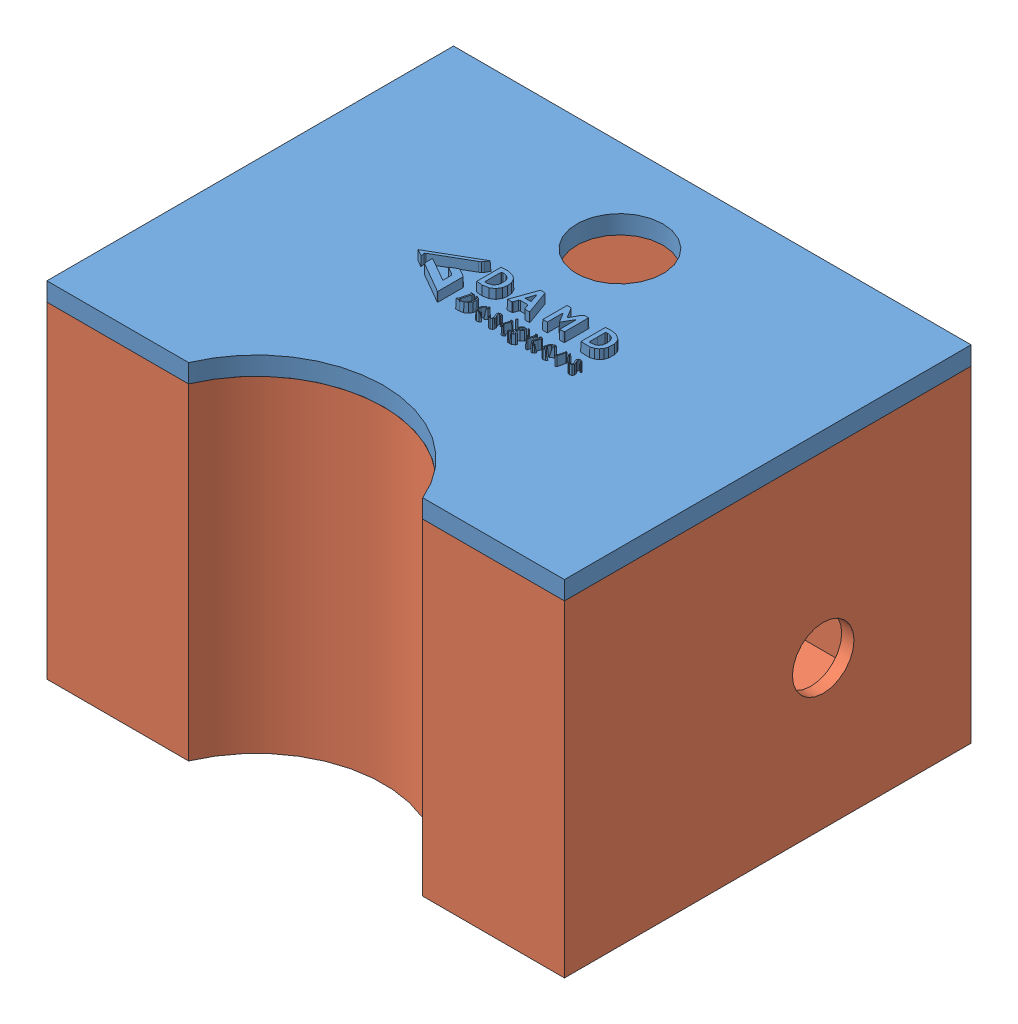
SolidWorks assembly airfreshner_enclosure assemble.sldasm, configuration Default (file format 15000). Lengths in mm.
Overall size (84 57.5 66).
2 component instances, 2 part files, 3 mates.
Components (placement in the parent):
- base_cover-1: base_cover.SLDPRT [Default] at (-11.6226 58.2156 86.695) size (84 4.5 66)
- base-1: base.SLDPRT [Default] at (-9.6226 8.2156 84.695) size (84 53 66)
Mates (geometry in assembly coordinates):
- Coincident1: coincident: plane of base_cover-1 through (72.3774 61.2156 20.695) normal (1 0 0); plane of base-1 through (72.3774 5.2156 20.695) normal (1 0 0)
- Coincident2: coincident: plane of base_cover-1 through (30.3774 58.2156 94.695) normal (0 -1 0); plane of base-1 through (30.3774 58.2156 94.695) normal (0 1 0)
- Coincident3: coincident aligned: plane of base_cover-1 through (-11.6226 61.2156 86.695) normal (0 0 1); plane of base-1 through (-11.6226 5.2156 86.695) normal (0 0 1)
